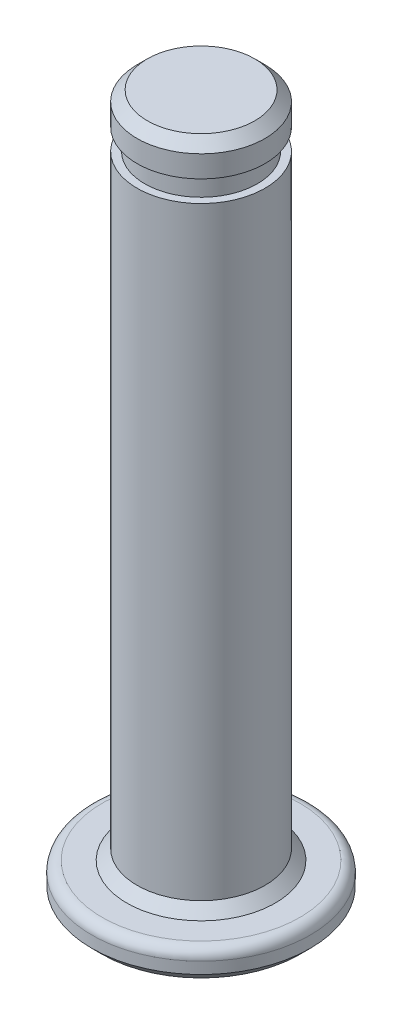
ISO-10303-21;
HEADER;
FILE_DESCRIPTION(('STEP AP214'),'2;1');
FILE_NAME('part.step','',(''),(''),'','','');
FILE_SCHEMA(('AUTOMOTIVE_DESIGN { 1 0 10303 214 1 1 1 1 }'));
ENDSEC;
DATA;
#1=APPLICATION_CONTEXT('core data for automotive mechanical design processes');
#2=APPLICATION_PROTOCOL_DEFINITION('international standard','automotive_design',2000,#1);
#3=PRODUCT_CONTEXT('',#1,'mechanical');
#4=PRODUCT('Part','Part','',(#3));
#5=PRODUCT_RELATED_PRODUCT_CATEGORY('part','',(#4));
#6=PRODUCT_DEFINITION_FORMATION('','',#4);
#7=PRODUCT_DEFINITION_CONTEXT('part definition',#1,'design');
#8=PRODUCT_DEFINITION('design','',#6,#7);
#9=PRODUCT_DEFINITION_SHAPE('','',#8);
#10=(LENGTH_UNIT() NAMED_UNIT(*) SI_UNIT(.MILLI.,.METRE.));
#11=(NAMED_UNIT(*) PLANE_ANGLE_UNIT() SI_UNIT($,.RADIAN.));
#12=(NAMED_UNIT(*) SI_UNIT($,.STERADIAN.) SOLID_ANGLE_UNIT());
#13=UNCERTAINTY_MEASURE_WITH_UNIT(LENGTH_MEASURE(1.E-05),#10,'distance_accuracy_value','');
#14=(GEOMETRIC_REPRESENTATION_CONTEXT(3) GLOBAL_UNCERTAINTY_ASSIGNED_CONTEXT((#13)) GLOBAL_UNIT_ASSIGNED_CONTEXT((#10,
#11,#12)) REPRESENTATION_CONTEXT('',''));
#15=CARTESIAN_POINT('',(0.,0.,0.));
#16=DIRECTION('',(0.,0.,1.));
#17=DIRECTION('',(1.,0.,0.));
#18=AXIS2_PLACEMENT_3D('',#15,#16,#17);
#19=CARTESIAN_POINT('',(0.303199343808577,37.2781897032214,0.));
#20=DIRECTION('',(0.,1.,0.));
#21=DIRECTION('',(0.,0.,1.));
#22=AXIS2_PLACEMENT_3D('',#19,#20,#21);
#23=PLANE('',#22);
#24=CARTESIAN_POINT('',(0.,37.2781897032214,0.));
#25=DIRECTION('',(0.,1.,0.));
#26=DIRECTION('',(0.,0.,1.));
#27=AXIS2_PLACEMENT_3D('',#24,#25,#26);
#28=CIRCLE('',#27,7.366);
#29=CARTESIAN_POINT('',(0.,37.2781897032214,7.366));
#30=VERTEX_POINT('',#29);
#31=EDGE_CURVE('E43',#30,#30,#28,.F.);
#32=ORIENTED_EDGE('',*,*,#31,.T.);
#33=EDGE_LOOP('',(#32));
#34=FACE_BOUND('',#33,.T.);
#35=ADVANCED_FACE('F29',(#34),#23,.F.);
#36=CARTESIAN_POINT('',(0.,0.,0.));
#37=DIRECTION('',(0.,-1.,0.));
#38=DIRECTION('',(0.,0.,-1.));
#39=AXIS2_PLACEMENT_3D('',#36,#37,#38);
#40=CYLINDRICAL_SURFACE('',#39,8.128);
#41=CARTESIAN_POINT('',(0.,38.8974397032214,0.));
#42=DIRECTION('',(0.,-1.,0.));
#43=DIRECTION('',(0.,0.,-1.));
#44=AXIS2_PLACEMENT_3D('',#41,#42,#43);
#45=CIRCLE('',#44,8.128);
#46=CARTESIAN_POINT('',(0.,38.8974397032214,-8.128));
#47=VERTEX_POINT('',#46);
#48=EDGE_CURVE('E35',#47,#47,#45,.T.);
#49=ORIENTED_EDGE('',*,*,#48,.T.);
#50=EDGE_LOOP('',(#49));
#51=FACE_BOUND('',#50,.T.);
#52=CARTESIAN_POINT('',(0.,38.0401897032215,0.));
#53=DIRECTION('',(0.,1.,0.));
#54=DIRECTION('',(0.,0.,1.));
#55=AXIS2_PLACEMENT_3D('',#52,#53,#54);
#56=CIRCLE('',#55,8.128);
#57=CARTESIAN_POINT('',(0.,38.0401897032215,8.128));
#58=VERTEX_POINT('',#57);
#59=EDGE_CURVE('E39',#58,#58,#56,.T.);
#60=ORIENTED_EDGE('',*,*,#59,.T.);
#61=EDGE_LOOP('',(#60));
#62=FACE_BOUND('',#61,.T.);
#63=ADVANCED_FACE('F91',(#51,#62),#40,.T.);
#64=CARTESIAN_POINT('',(0.303199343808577,39.6594397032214,0.));
#65=DIRECTION('',(0.,-1.,0.));
#66=DIRECTION('',(0.,0.,-1.));
#67=AXIS2_PLACEMENT_3D('',#64,#65,#66);
#68=PLANE('',#67);
#69=CARTESIAN_POINT('',(0.,39.6594397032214,0.));
#70=DIRECTION('',(0.,-1.,0.));
#71=DIRECTION('',(0.,0.,-1.));
#72=AXIS2_PLACEMENT_3D('',#69,#70,#71);
#73=CIRCLE('',#72,7.366);
#74=CARTESIAN_POINT('',(0.,39.6594397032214,-7.366));
#75=VERTEX_POINT('',#74);
#76=EDGE_CURVE('E10',#75,#75,#73,.F.);
#77=ORIENTED_EDGE('',*,*,#76,.T.);
#78=EDGE_LOOP('',(#77));
#79=FACE_BOUND('',#78,.T.);
#80=CARTESIAN_POINT('',(0.,39.6594397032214,0.));
#81=DIRECTION('',(0.,-1.,0.));
#82=DIRECTION('',(0.,0.,-1.));
#83=AXIS2_PLACEMENT_3D('',#80,#81,#82);
#84=CIRCLE('',#83,5.52450000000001);
#85=CARTESIAN_POINT('',(0.,39.6594397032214,-5.52450000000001));
#86=VERTEX_POINT('',#85);
#87=EDGE_CURVE('E51',#86,#86,#84,.T.);
#88=ORIENTED_EDGE('',*,*,#87,.T.);
#89=EDGE_LOOP('',(#88));
#90=FACE_BOUND('',#89,.T.);
#91=ADVANCED_FACE('F96',(#79,#90),#68,.F.);
#92=CARTESIAN_POINT('',(0.,0.,0.));
#93=DIRECTION('',(0.,-1.,0.));
#94=DIRECTION('',(0.,0.,-1.));
#95=AXIS2_PLACEMENT_3D('',#92,#93,#94);
#96=CYLINDRICAL_SURFACE('',#95,4.76250000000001);
#97=CARTESIAN_POINT('',(0.,40.4214397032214,0.));
#98=DIRECTION('',(0.,-1.,0.));
#99=DIRECTION('',(0.,0.,-1.));
#100=AXIS2_PLACEMENT_3D('',#97,#98,#99);
#101=CIRCLE('',#100,4.76250000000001);
#102=CARTESIAN_POINT('',(0.,40.4214397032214,-4.76250000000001));
#103=VERTEX_POINT('',#102);
#104=EDGE_CURVE('E48',#103,#103,#101,.F.);
#105=ORIENTED_EDGE('',*,*,#104,.T.);
#106=EDGE_LOOP('',(#105));
#107=FACE_BOUND('',#106,.T.);
#108=CARTESIAN_POINT('',(0.,85.3794397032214,0.));
#109=DIRECTION('',(0.,-1.,0.));
#110=DIRECTION('',(0.,0.,-1.));
#111=AXIS2_PLACEMENT_3D('',#108,#109,#110);
#112=CIRCLE('',#111,4.7625);
#113=CARTESIAN_POINT('',(0.,85.3794397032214,-4.7625));
#114=VERTEX_POINT('',#113);
#115=EDGE_CURVE('E60',#114,#114,#112,.T.);
#116=ORIENTED_EDGE('',*,*,#115,.T.);
#117=EDGE_LOOP('',(#116));
#118=FACE_BOUND('',#117,.T.);
#119=ADVANCED_FACE('F134',(#107,#118),#96,.T.);
#120=CARTESIAN_POINT('',(0.303199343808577,85.3794397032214,0.));
#121=DIRECTION('',(0.,-1.,0.));
#122=DIRECTION('',(0.,0.,-1.));
#123=AXIS2_PLACEMENT_3D('',#120,#121,#122);
#124=PLANE('',#123);
#125=ORIENTED_EDGE('',*,*,#115,.F.);
#126=EDGE_LOOP('',(#125));
#127=FACE_BOUND('',#126,.T.);
#128=CARTESIAN_POINT('',(0.,85.3794397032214,0.));
#129=DIRECTION('',(0.,-1.,0.));
#130=DIRECTION('',(0.,0.,-1.));
#131=AXIS2_PLACEMENT_3D('',#128,#129,#130);
#132=CIRCLE('',#131,4.191);
#133=CARTESIAN_POINT('',(0.,85.3794397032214,-4.191));
#134=VERTEX_POINT('',#133);
#135=EDGE_CURVE('E63',#134,#134,#132,.T.);
#136=ORIENTED_EDGE('',*,*,#135,.T.);
#137=EDGE_LOOP('',(#136));
#138=FACE_BOUND('',#137,.T.);
#139=ADVANCED_FACE('F167',(#127,#138),#124,.F.);
#140=CARTESIAN_POINT('',(0.,0.,0.));
#141=DIRECTION('',(0.,-1.,0.));
#142=DIRECTION('',(0.,0.,-1.));
#143=AXIS2_PLACEMENT_3D('',#140,#141,#142);
#144=CYLINDRICAL_SURFACE('',#143,4.191);
#145=ORIENTED_EDGE('',*,*,#135,.F.);
#146=EDGE_LOOP('',(#145));
#147=FACE_BOUND('',#146,.T.);
#148=CARTESIAN_POINT('',(0.,86.9669397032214,0.));
#149=DIRECTION('',(0.,-1.,0.));
#150=DIRECTION('',(0.,0.,-1.));
#151=AXIS2_PLACEMENT_3D('',#148,#149,#150);
#152=CIRCLE('',#151,4.191);
#153=CARTESIAN_POINT('',(0.,86.9669397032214,-4.191));
#154=VERTEX_POINT('',#153);
#155=EDGE_CURVE('E66',#154,#154,#152,.T.);
#156=ORIENTED_EDGE('',*,*,#155,.T.);
#157=EDGE_LOOP('',(#156));
#158=FACE_BOUND('',#157,.T.);
#159=ADVANCED_FACE('F87',(#147,#158),#144,.T.);
#160=CARTESIAN_POINT('',(0.303199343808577,86.9669397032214,0.));
#161=DIRECTION('',(0.,1.,0.));
#162=DIRECTION('',(0.,0.,1.));
#163=AXIS2_PLACEMENT_3D('',#160,#161,#162);
#164=PLANE('',#163);
#165=ORIENTED_EDGE('',*,*,#155,.F.);
#166=EDGE_LOOP('',(#165));
#167=FACE_BOUND('',#166,.T.);
#168=CARTESIAN_POINT('',(0.,86.9669397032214,0.));
#169=DIRECTION('',(0.,-1.,0.));
#170=DIRECTION('',(0.,0.,-1.));
#171=AXIS2_PLACEMENT_3D('',#168,#169,#170);
#172=CIRCLE('',#171,4.7625);
#173=CARTESIAN_POINT('',(0.,86.9669397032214,-4.7625));
#174=VERTEX_POINT('',#173);
#175=EDGE_CURVE('E69',#174,#174,#172,.T.);
#176=ORIENTED_EDGE('',*,*,#175,.T.);
#177=EDGE_LOOP('',(#176));
#178=FACE_BOUND('',#177,.T.);
#179=ADVANCED_FACE('F73',(#167,#178),#164,.F.);
#180=CARTESIAN_POINT('',(0.,0.,0.));
#181=DIRECTION('',(0.,-1.,0.));
#182=DIRECTION('',(0.,0.,-1.));
#183=AXIS2_PLACEMENT_3D('',#180,#181,#182);
#184=CYLINDRICAL_SURFACE('',#183,4.7625);
#185=CARTESIAN_POINT('',(0.,88.5861897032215,0.));
#186=DIRECTION('',(0.,-1.,0.));
#187=DIRECTION('',(0.,0.,-1.));
#188=AXIS2_PLACEMENT_3D('',#185,#186,#187);
#189=CIRCLE('',#188,4.7625);
#190=CARTESIAN_POINT('',(0.,88.5861897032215,-4.7625));
#191=VERTEX_POINT('',#190);
#192=EDGE_CURVE('E57',#191,#191,#189,.T.);
#193=ORIENTED_EDGE('',*,*,#192,.T.);
#194=EDGE_LOOP('',(#193));
#195=FACE_BOUND('',#194,.T.);
#196=ORIENTED_EDGE('',*,*,#175,.F.);
#197=EDGE_LOOP('',(#196));
#198=FACE_BOUND('',#197,.T.);
#199=ADVANCED_FACE('F75',(#195,#198),#184,.T.);
#200=CARTESIAN_POINT('',(0.303199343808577,89.3481897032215,0.));
#201=DIRECTION('',(0.,-1.,0.));
#202=DIRECTION('',(0.,0.,-1.));
#203=AXIS2_PLACEMENT_3D('',#200,#201,#202);
#204=PLANE('',#203);
#205=CARTESIAN_POINT('',(0.,89.3481897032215,0.));
#206=DIRECTION('',(0.,-1.,0.));
#207=DIRECTION('',(0.,0.,-1.));
#208=AXIS2_PLACEMENT_3D('',#205,#206,#207);
#209=CIRCLE('',#208,4.0005);
#210=CARTESIAN_POINT('',(0.,89.3481897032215,-4.0005));
#211=VERTEX_POINT('',#210);
#212=EDGE_CURVE('E54',#211,#211,#209,.F.);
#213=ORIENTED_EDGE('',*,*,#212,.T.);
#214=EDGE_LOOP('',(#213));
#215=FACE_BOUND('',#214,.T.);
#216=ADVANCED_FACE('F77',(#215),#204,.F.);
#217=CARTESIAN_POINT('',(0.,88.5861897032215,0.));
#218=DIRECTION('',(0.,-1.,0.));
#219=DIRECTION('',(0.,0.,-1.));
#220=AXIS2_PLACEMENT_3D('',#217,#218,#219);
#221=CONICAL_SURFACE('',#220,4.7625,0.785398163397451);
#222=ORIENTED_EDGE('',*,*,#212,.F.);
#223=EDGE_LOOP('',(#222));
#224=FACE_BOUND('',#223,.T.);
#225=ORIENTED_EDGE('',*,*,#192,.F.);
#226=EDGE_LOOP('',(#225));
#227=FACE_BOUND('',#226,.T.);
#228=ADVANCED_FACE('F84',(#224,#227),#221,.T.);
#229=CARTESIAN_POINT('',(0.,39.6594397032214,0.));
#230=DIRECTION('',(0.,-1.,0.));
#231=DIRECTION('',(0.,0.,-1.));
#232=AXIS2_PLACEMENT_3D('',#229,#230,#231);
#233=CONICAL_SURFACE('',#232,5.52450000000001,0.785398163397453);
#234=ORIENTED_EDGE('',*,*,#104,.F.);
#235=EDGE_LOOP('',(#234));
#236=FACE_BOUND('',#235,.T.);
#237=ORIENTED_EDGE('',*,*,#87,.F.);
#238=EDGE_LOOP('',(#237));
#239=FACE_BOUND('',#238,.T.);
#240=ADVANCED_FACE('F102',(#236,#239),#233,.T.);
#241=CARTESIAN_POINT('',(0.,37.2781897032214,0.));
#242=DIRECTION('',(0.,1.,0.));
#243=DIRECTION('',(0.,0.,1.));
#244=AXIS2_PLACEMENT_3D('',#241,#242,#243);
#245=CONICAL_SURFACE('',#244,7.366,0.785398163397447);
#246=ORIENTED_EDGE('',*,*,#59,.F.);
#247=EDGE_LOOP('',(#246));
#248=FACE_BOUND('',#247,.T.);
#249=ORIENTED_EDGE('',*,*,#31,.F.);
#250=EDGE_LOOP('',(#249));
#251=FACE_BOUND('',#250,.T.);
#252=ADVANCED_FACE('F99',(#248,#251),#245,.T.);
#253=CARTESIAN_POINT('',(0.,38.8974397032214,0.));
#254=DIRECTION('',(0.,-1.,0.));
#255=DIRECTION('',(0.,0.,-1.));
#256=AXIS2_PLACEMENT_3D('',#253,#254,#255);
#257=TOROIDAL_SURFACE('',#256,7.366,0.762);
#258=ORIENTED_EDGE('',*,*,#76,.F.);
#259=EDGE_LOOP('',(#258));
#260=FACE_BOUND('',#259,.T.);
#261=ORIENTED_EDGE('',*,*,#48,.F.);
#262=EDGE_LOOP('',(#261));
#263=FACE_BOUND('',#262,.T.);
#264=ADVANCED_FACE('F101',(#260,#263),#257,.T.);
#265=CLOSED_SHELL('',(#35,#63,#91,#119,#139,#159,#179,#199,#216,#228,#240,#252,#264));
#266=MANIFOLD_SOLID_BREP('B2',#265);
#267=ADVANCED_BREP_SHAPE_REPRESENTATION('',(#18,#266),#14);
#268=SHAPE_DEFINITION_REPRESENTATION(#9,#267);
ENDSEC;
END-ISO-10303-21;
